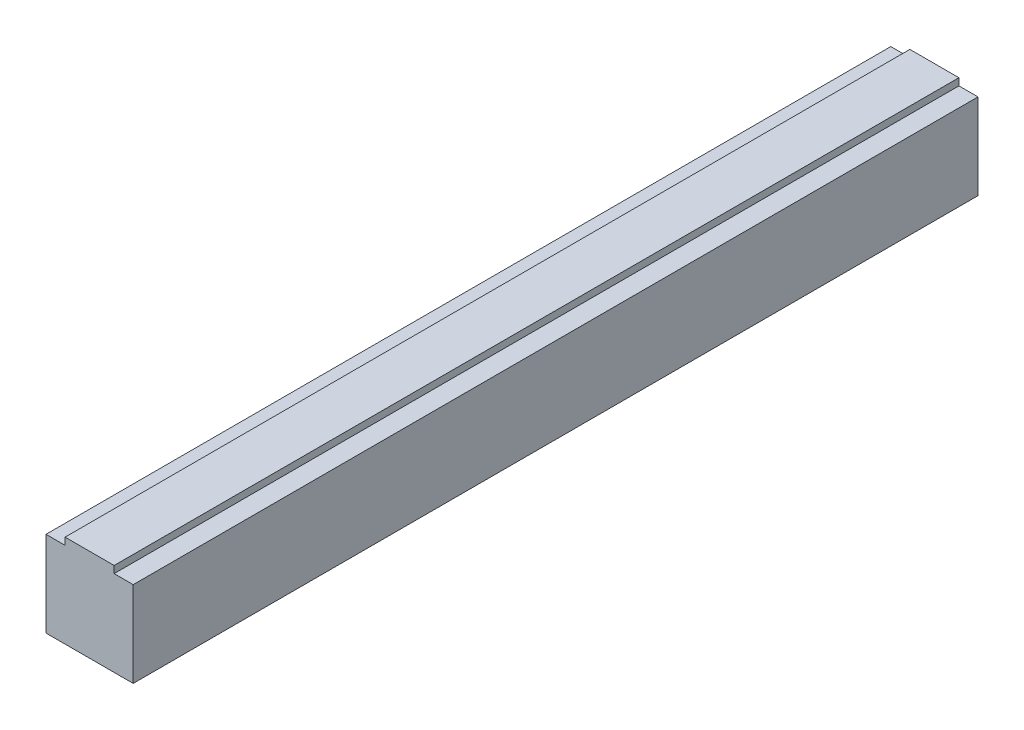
ISO-10303-21;
HEADER;
FILE_DESCRIPTION(('STEP AP214'),'2;1');
FILE_NAME('part.step','',(''),(''),'','','');
FILE_SCHEMA(('AUTOMOTIVE_DESIGN { 1 0 10303 214 1 1 1 1 }'));
ENDSEC;
DATA;
#1=APPLICATION_CONTEXT('core data for automotive mechanical design processes');
#2=APPLICATION_PROTOCOL_DEFINITION('international standard','automotive_design',2000,#1);
#3=PRODUCT_CONTEXT('',#1,'mechanical');
#4=PRODUCT('Part','Part','',(#3));
#5=PRODUCT_RELATED_PRODUCT_CATEGORY('part','',(#4));
#6=PRODUCT_DEFINITION_FORMATION('','',#4);
#7=PRODUCT_DEFINITION_CONTEXT('part definition',#1,'design');
#8=PRODUCT_DEFINITION('design','',#6,#7);
#9=PRODUCT_DEFINITION_SHAPE('','',#8);
#10=(LENGTH_UNIT() NAMED_UNIT(*) SI_UNIT(.MILLI.,.METRE.));
#11=(NAMED_UNIT(*) PLANE_ANGLE_UNIT() SI_UNIT($,.RADIAN.));
#12=(NAMED_UNIT(*) SI_UNIT($,.STERADIAN.) SOLID_ANGLE_UNIT());
#13=UNCERTAINTY_MEASURE_WITH_UNIT(LENGTH_MEASURE(1.E-05),#10,'distance_accuracy_value','');
#14=(GEOMETRIC_REPRESENTATION_CONTEXT(3) GLOBAL_UNCERTAINTY_ASSIGNED_CONTEXT((#13)) GLOBAL_UNIT_ASSIGNED_CONTEXT((#10,
#11,#12)) REPRESENTATION_CONTEXT('',''));
#15=CARTESIAN_POINT('',(0.,0.,0.));
#16=DIRECTION('',(0.,0.,1.));
#17=DIRECTION('',(1.,0.,0.));
#18=AXIS2_PLACEMENT_3D('',#15,#16,#17);
#19=CARTESIAN_POINT('',(7.99999999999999,28.4606508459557,-160.));
#20=DIRECTION('',(1.,0.,0.));
#21=DIRECTION('',(0.,1.,0.));
#22=AXIS2_PLACEMENT_3D('',#19,#20,#21);
#23=PLANE('',#22);
#24=DIRECTION('',(0.,1.,0.));
#25=VECTOR('',#24,1.);
#26=CARTESIAN_POINT('',(7.99999999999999,28.4606508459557,-5.));
#27=LINE('',#26,#25);
#28=CARTESIAN_POINT('',(8.,12.7606508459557,-5.));
#29=VERTEX_POINT('',#28);
#30=CARTESIAN_POINT('',(7.99999999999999,28.4606508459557,-5.));
#31=VERTEX_POINT('',#30);
#32=EDGE_CURVE('E129',#29,#31,#27,.T.);
#33=ORIENTED_EDGE('',*,*,#32,.F.);
#34=DIRECTION('',(0.,0.,1.));
#35=VECTOR('',#34,1.);
#36=CARTESIAN_POINT('',(8.,12.7606508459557,-160.));
#37=LINE('',#36,#35);
#38=CARTESIAN_POINT('',(8.,12.7606508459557,-160.));
#39=VERTEX_POINT('',#38);
#40=EDGE_CURVE('E11',#39,#29,#37,.T.);
#41=ORIENTED_EDGE('',*,*,#40,.F.);
#42=DIRECTION('',(0.,1.,0.));
#43=VECTOR('',#42,1.);
#44=CARTESIAN_POINT('',(7.99999999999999,28.4606508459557,-160.));
#45=LINE('',#44,#43);
#46=CARTESIAN_POINT('',(7.99999999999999,28.4606508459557,-160.));
#47=VERTEX_POINT('',#46);
#48=EDGE_CURVE('E149',#39,#47,#45,.T.);
#49=ORIENTED_EDGE('',*,*,#48,.T.);
#50=DIRECTION('',(0.,0.,1.));
#51=VECTOR('',#50,1.);
#52=CARTESIAN_POINT('',(7.99999999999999,28.4606508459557,-160.));
#53=LINE('',#52,#51);
#54=EDGE_CURVE('E35',#47,#31,#53,.T.);
#55=ORIENTED_EDGE('',*,*,#54,.T.);
#56=EDGE_LOOP('',(#33,#41,#49,#55));
#57=FACE_BOUND('',#56,.T.);
#58=ADVANCED_FACE('F32',(#57),#23,.T.);
#59=CARTESIAN_POINT('',(-8.,12.7606508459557,-160.));
#60=DIRECTION('',(0.,-1.,0.));
#61=DIRECTION('',(0.,0.,-1.));
#62=AXIS2_PLACEMENT_3D('',#59,#60,#61);
#63=PLANE('',#62);
#64=DIRECTION('',(1.,0.,0.));
#65=VECTOR('',#64,1.);
#66=CARTESIAN_POINT('',(-8.,12.7606508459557,-5.));
#67=LINE('',#66,#65);
#68=CARTESIAN_POINT('',(-8.,12.7606508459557,-5.));
#69=VERTEX_POINT('',#68);
#70=EDGE_CURVE('E147',#69,#29,#67,.T.);
#71=ORIENTED_EDGE('',*,*,#70,.F.);
#72=DIRECTION('',(0.,0.,1.));
#73=VECTOR('',#72,1.);
#74=CARTESIAN_POINT('',(-8.,12.7606508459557,-160.));
#75=LINE('',#74,#73);
#76=CARTESIAN_POINT('',(-8.,12.7606508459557,-160.));
#77=VERTEX_POINT('',#76);
#78=EDGE_CURVE('E41',#77,#69,#75,.T.);
#79=ORIENTED_EDGE('',*,*,#78,.F.);
#80=DIRECTION('',(1.,0.,0.));
#81=VECTOR('',#80,1.);
#82=CARTESIAN_POINT('',(-8.,12.7606508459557,-160.));
#83=LINE('',#82,#81);
#84=EDGE_CURVE('E119',#77,#39,#83,.T.);
#85=ORIENTED_EDGE('',*,*,#84,.T.);
#86=ORIENTED_EDGE('',*,*,#40,.T.);
#87=EDGE_LOOP('',(#71,#79,#85,#86));
#88=FACE_BOUND('',#87,.T.);
#89=ADVANCED_FACE('F161',(#88),#63,.T.);
#90=CARTESIAN_POINT('',(-8.,28.4606508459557,-160.));
#91=DIRECTION('',(-1.,0.,0.));
#92=DIRECTION('',(0.,-1.,0.));
#93=AXIS2_PLACEMENT_3D('',#90,#91,#92);
#94=PLANE('',#93);
#95=DIRECTION('',(0.,-1.,0.));
#96=VECTOR('',#95,1.);
#97=CARTESIAN_POINT('',(-8.,28.4606508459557,-5.));
#98=LINE('',#97,#96);
#99=CARTESIAN_POINT('',(-8.,28.4606508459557,-5.));
#100=VERTEX_POINT('',#99);
#101=EDGE_CURVE('E106',#100,#69,#98,.T.);
#102=ORIENTED_EDGE('',*,*,#101,.F.);
#103=DIRECTION('',(0.,0.,1.));
#104=VECTOR('',#103,1.);
#105=CARTESIAN_POINT('',(-8.,28.4606508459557,-160.));
#106=LINE('',#105,#104);
#107=CARTESIAN_POINT('',(-8.,28.4606508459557,-160.));
#108=VERTEX_POINT('',#107);
#109=EDGE_CURVE('E101',#108,#100,#106,.T.);
#110=ORIENTED_EDGE('',*,*,#109,.F.);
#111=DIRECTION('',(0.,-1.,0.));
#112=VECTOR('',#111,1.);
#113=CARTESIAN_POINT('',(-8.,28.4606508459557,-160.));
#114=LINE('',#113,#112);
#115=EDGE_CURVE('E104',#108,#77,#114,.T.);
#116=ORIENTED_EDGE('',*,*,#115,.T.);
#117=ORIENTED_EDGE('',*,*,#78,.T.);
#118=EDGE_LOOP('',(#102,#110,#116,#117));
#119=FACE_BOUND('',#118,.T.);
#120=ADVANCED_FACE('F103',(#119),#94,.T.);
#121=CARTESIAN_POINT('',(-4.5,28.4606508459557,-160.));
#122=DIRECTION('',(0.,1.,0.));
#123=DIRECTION('',(0.,0.,1.));
#124=AXIS2_PLACEMENT_3D('',#121,#122,#123);
#125=PLANE('',#124);
#126=DIRECTION('',(-1.,0.,0.));
#127=VECTOR('',#126,1.);
#128=CARTESIAN_POINT('',(-4.5,28.4606508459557,-5.));
#129=LINE('',#128,#127);
#130=CARTESIAN_POINT('',(-4.5,28.4606508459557,-5.));
#131=VERTEX_POINT('',#130);
#132=EDGE_CURVE('E144',#131,#100,#129,.T.);
#133=ORIENTED_EDGE('',*,*,#132,.F.);
#134=DIRECTION('',(0.,0.,1.));
#135=VECTOR('',#134,1.);
#136=CARTESIAN_POINT('',(-4.5,28.4606508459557,-160.));
#137=LINE('',#136,#135);
#138=CARTESIAN_POINT('',(-4.5,28.4606508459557,-160.));
#139=VERTEX_POINT('',#138);
#140=EDGE_CURVE('E111',#139,#131,#137,.T.);
#141=ORIENTED_EDGE('',*,*,#140,.F.);
#142=DIRECTION('',(-1.,0.,0.));
#143=VECTOR('',#142,1.);
#144=CARTESIAN_POINT('',(-4.5,28.4606508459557,-160.));
#145=LINE('',#144,#143);
#146=EDGE_CURVE('E117',#139,#108,#145,.T.);
#147=ORIENTED_EDGE('',*,*,#146,.T.);
#148=ORIENTED_EDGE('',*,*,#109,.T.);
#149=EDGE_LOOP('',(#133,#141,#147,#148));
#150=FACE_BOUND('',#149,.T.);
#151=ADVANCED_FACE('F121',(#150),#125,.T.);
#152=CARTESIAN_POINT('',(-4.5,29.7606508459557,-160.));
#153=DIRECTION('',(-1.,0.,0.));
#154=DIRECTION('',(0.,-1.,0.));
#155=AXIS2_PLACEMENT_3D('',#152,#153,#154);
#156=PLANE('',#155);
#157=DIRECTION('',(0.,-1.,0.));
#158=VECTOR('',#157,1.);
#159=CARTESIAN_POINT('',(-4.5,29.7606508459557,-5.));
#160=LINE('',#159,#158);
#161=CARTESIAN_POINT('',(-4.5,29.7606508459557,-5.));
#162=VERTEX_POINT('',#161);
#163=EDGE_CURVE('E141',#162,#131,#160,.T.);
#164=ORIENTED_EDGE('',*,*,#163,.F.);
#165=DIRECTION('',(0.,0.,1.));
#166=VECTOR('',#165,1.);
#167=CARTESIAN_POINT('',(-4.5,29.7606508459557,-160.));
#168=LINE('',#167,#166);
#169=CARTESIAN_POINT('',(-4.5,29.7606508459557,-160.));
#170=VERTEX_POINT('',#169);
#171=EDGE_CURVE('E153',#170,#162,#168,.T.);
#172=ORIENTED_EDGE('',*,*,#171,.F.);
#173=DIRECTION('',(0.,-1.,0.));
#174=VECTOR('',#173,1.);
#175=CARTESIAN_POINT('',(-4.5,29.7606508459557,-160.));
#176=LINE('',#175,#174);
#177=EDGE_CURVE('E122',#170,#139,#176,.T.);
#178=ORIENTED_EDGE('',*,*,#177,.T.);
#179=ORIENTED_EDGE('',*,*,#140,.T.);
#180=EDGE_LOOP('',(#164,#172,#178,#179));
#181=FACE_BOUND('',#180,.T.);
#182=ADVANCED_FACE('F174',(#181),#156,.T.);
#183=CARTESIAN_POINT('',(-4.5,29.7606508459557,-160.));
#184=DIRECTION('',(0.,1.,0.));
#185=DIRECTION('',(0.,0.,1.));
#186=AXIS2_PLACEMENT_3D('',#183,#184,#185);
#187=PLANE('',#186);
#188=DIRECTION('',(-1.,0.,0.));
#189=VECTOR('',#188,1.);
#190=CARTESIAN_POINT('',(-4.5,29.7606508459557,-5.));
#191=LINE('',#190,#189);
#192=CARTESIAN_POINT('',(4.49999999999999,29.7606508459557,-5.));
#193=VERTEX_POINT('',#192);
#194=EDGE_CURVE('E138',#193,#162,#191,.T.);
#195=ORIENTED_EDGE('',*,*,#194,.F.);
#196=DIRECTION('',(0.,0.,1.));
#197=VECTOR('',#196,1.);
#198=CARTESIAN_POINT('',(4.49999999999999,29.7606508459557,-160.));
#199=LINE('',#198,#197);
#200=CARTESIAN_POINT('',(4.49999999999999,29.7606508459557,-160.));
#201=VERTEX_POINT('',#200);
#202=EDGE_CURVE('E155',#201,#193,#199,.T.);
#203=ORIENTED_EDGE('',*,*,#202,.F.);
#204=DIRECTION('',(-1.,0.,0.));
#205=VECTOR('',#204,1.);
#206=CARTESIAN_POINT('',(-4.5,29.7606508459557,-160.));
#207=LINE('',#206,#205);
#208=EDGE_CURVE('E124',#201,#170,#207,.T.);
#209=ORIENTED_EDGE('',*,*,#208,.T.);
#210=ORIENTED_EDGE('',*,*,#171,.T.);
#211=EDGE_LOOP('',(#195,#203,#209,#210));
#212=FACE_BOUND('',#211,.T.);
#213=ADVANCED_FACE('F177',(#212),#187,.T.);
#214=CARTESIAN_POINT('',(4.49999999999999,29.7606508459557,-160.));
#215=DIRECTION('',(1.,0.,0.));
#216=DIRECTION('',(0.,1.,0.));
#217=AXIS2_PLACEMENT_3D('',#214,#215,#216);
#218=PLANE('',#217);
#219=DIRECTION('',(0.,1.,0.));
#220=VECTOR('',#219,1.);
#221=CARTESIAN_POINT('',(4.49999999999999,29.7606508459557,-5.));
#222=LINE('',#221,#220);
#223=CARTESIAN_POINT('',(4.49999999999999,28.4606508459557,-5.));
#224=VERTEX_POINT('',#223);
#225=EDGE_CURVE('E135',#224,#193,#222,.T.);
#226=ORIENTED_EDGE('',*,*,#225,.F.);
#227=DIRECTION('',(0.,0.,1.));
#228=VECTOR('',#227,1.);
#229=CARTESIAN_POINT('',(4.49999999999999,28.4606508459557,-160.));
#230=LINE('',#229,#228);
#231=CARTESIAN_POINT('',(4.49999999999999,28.4606508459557,-160.));
#232=VERTEX_POINT('',#231);
#233=EDGE_CURVE('E156',#232,#224,#230,.T.);
#234=ORIENTED_EDGE('',*,*,#233,.F.);
#235=DIRECTION('',(0.,1.,0.));
#236=VECTOR('',#235,1.);
#237=CARTESIAN_POINT('',(4.49999999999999,29.7606508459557,-160.));
#238=LINE('',#237,#236);
#239=EDGE_CURVE('E252',#232,#201,#238,.T.);
#240=ORIENTED_EDGE('',*,*,#239,.T.);
#241=ORIENTED_EDGE('',*,*,#202,.T.);
#242=EDGE_LOOP('',(#226,#234,#240,#241));
#243=FACE_BOUND('',#242,.T.);
#244=ADVANCED_FACE('F181',(#243),#218,.T.);
#245=CARTESIAN_POINT('',(4.49999999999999,28.4606508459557,-160.));
#246=DIRECTION('',(0.,1.,0.));
#247=DIRECTION('',(0.,0.,1.));
#248=AXIS2_PLACEMENT_3D('',#245,#246,#247);
#249=PLANE('',#248);
#250=DIRECTION('',(-1.,0.,0.));
#251=VECTOR('',#250,1.);
#252=CARTESIAN_POINT('',(4.49999999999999,28.4606508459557,-5.));
#253=LINE('',#252,#251);
#254=EDGE_CURVE('E132',#31,#224,#253,.T.);
#255=ORIENTED_EDGE('',*,*,#254,.F.);
#256=ORIENTED_EDGE('',*,*,#54,.F.);
#257=DIRECTION('',(-1.,0.,0.));
#258=VECTOR('',#257,1.);
#259=CARTESIAN_POINT('',(4.49999999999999,28.4606508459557,-160.));
#260=LINE('',#259,#258);
#261=EDGE_CURVE('E253',#47,#232,#260,.T.);
#262=ORIENTED_EDGE('',*,*,#261,.T.);
#263=ORIENTED_EDGE('',*,*,#233,.T.);
#264=EDGE_LOOP('',(#255,#256,#262,#263));
#265=FACE_BOUND('',#264,.T.);
#266=ADVANCED_FACE('F158',(#265),#249,.T.);
#267=CARTESIAN_POINT('',(0.,0.,-160.));
#268=DIRECTION('',(0.,0.,1.));
#269=DIRECTION('',(1.,0.,0.));
#270=AXIS2_PLACEMENT_3D('',#267,#268,#269);
#271=PLANE('',#270);
#272=ORIENTED_EDGE('',*,*,#48,.F.);
#273=ORIENTED_EDGE('',*,*,#84,.F.);
#274=ORIENTED_EDGE('',*,*,#115,.F.);
#275=ORIENTED_EDGE('',*,*,#146,.F.);
#276=ORIENTED_EDGE('',*,*,#177,.F.);
#277=ORIENTED_EDGE('',*,*,#208,.F.);
#278=ORIENTED_EDGE('',*,*,#239,.F.);
#279=ORIENTED_EDGE('',*,*,#261,.F.);
#280=EDGE_LOOP('',(#272,#273,#274,#275,#276,#277,#278,#279));
#281=FACE_BOUND('',#280,.T.);
#282=ADVANCED_FACE('F115',(#281),#271,.F.);
#283=CARTESIAN_POINT('',(0.,0.,-5.));
#284=DIRECTION('',(0.,0.,1.));
#285=DIRECTION('',(1.,0.,0.));
#286=AXIS2_PLACEMENT_3D('',#283,#284,#285);
#287=PLANE('',#286);
#288=ORIENTED_EDGE('',*,*,#32,.T.);
#289=ORIENTED_EDGE('',*,*,#254,.T.);
#290=ORIENTED_EDGE('',*,*,#225,.T.);
#291=ORIENTED_EDGE('',*,*,#194,.T.);
#292=ORIENTED_EDGE('',*,*,#163,.T.);
#293=ORIENTED_EDGE('',*,*,#132,.T.);
#294=ORIENTED_EDGE('',*,*,#101,.T.);
#295=ORIENTED_EDGE('',*,*,#70,.T.);
#296=EDGE_LOOP('',(#288,#289,#290,#291,#292,#293,#294,#295));
#297=FACE_BOUND('',#296,.T.);
#298=ADVANCED_FACE('F160',(#297),#287,.T.);
#299=CLOSED_SHELL('',(#58,#89,#120,#151,#182,#213,#244,#266,#282,#298));
#300=MANIFOLD_SOLID_BREP('B2',#299);
#301=ADVANCED_BREP_SHAPE_REPRESENTATION('',(#18,#300),#14);
#302=SHAPE_DEFINITION_REPRESENTATION(#9,#301);
ENDSEC;
END-ISO-10303-21;
